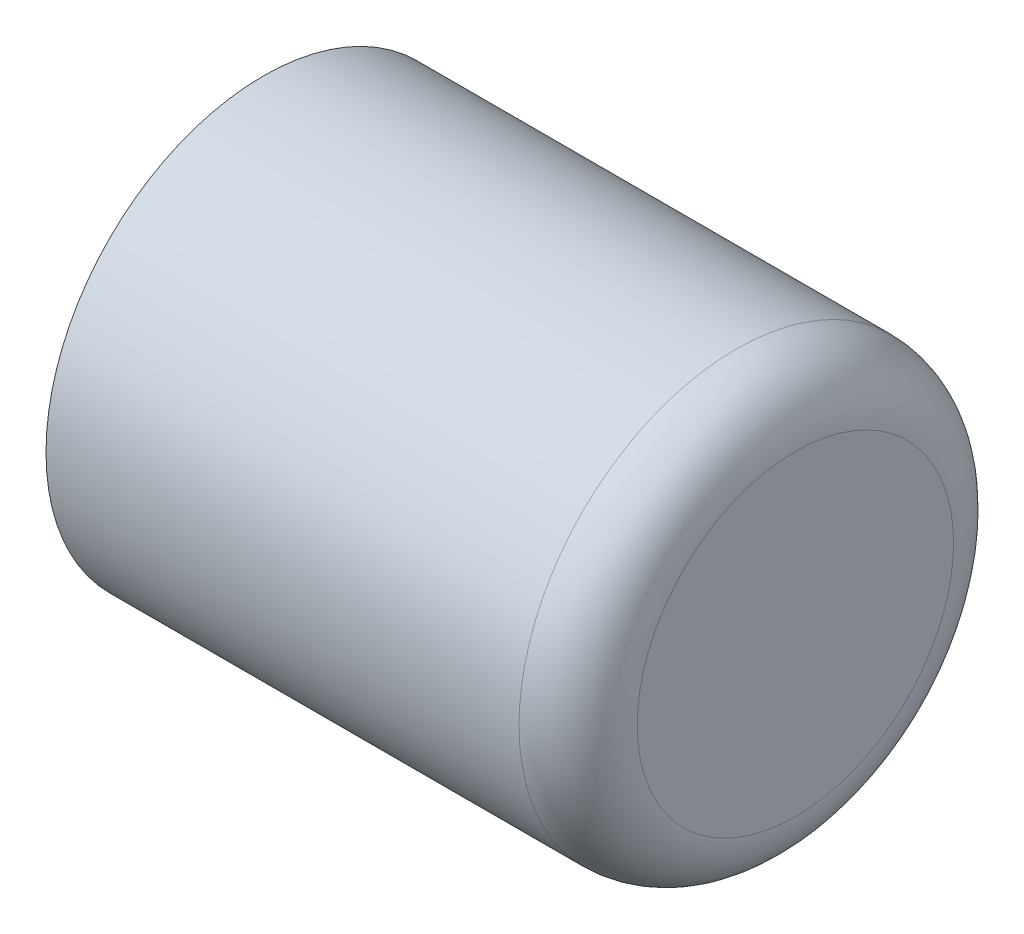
from build123d import *


with BuildPart() as part:
    # Esquisse1 → R_volution1 (revolve)
    with BuildSketch(Plane.XY, mode=Mode.PRIVATE) as r_volution1_sk:
        with BuildLine():
            Line((0, 7.35), (-16, 7.35))
            Line((-16, 7.35), (-16, 6.15))
            Line((-16, 6.15), (0, 6.15))
            ThreePointArc((0, 6.15), (0.565685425, 5.915685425), (0.8, 5.35))
            Line((0.8, 5.35), (0.8, 0))
            Line((0.8, 0), (2, 0))
            Line((2, 0), (2, 5.35))
            ThreePointArc((2, 5.35), (1.414213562, 6.764213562), (0, 7.35))
        make_face()
    revolve(r_volution1_sk.sketch.rotate(Axis((-43.182514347, 0, 0), (1, 0, 0)), 90), axis=Axis((-43.182514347, 0, 0), (1, 0, 0)))


solid = part.part
